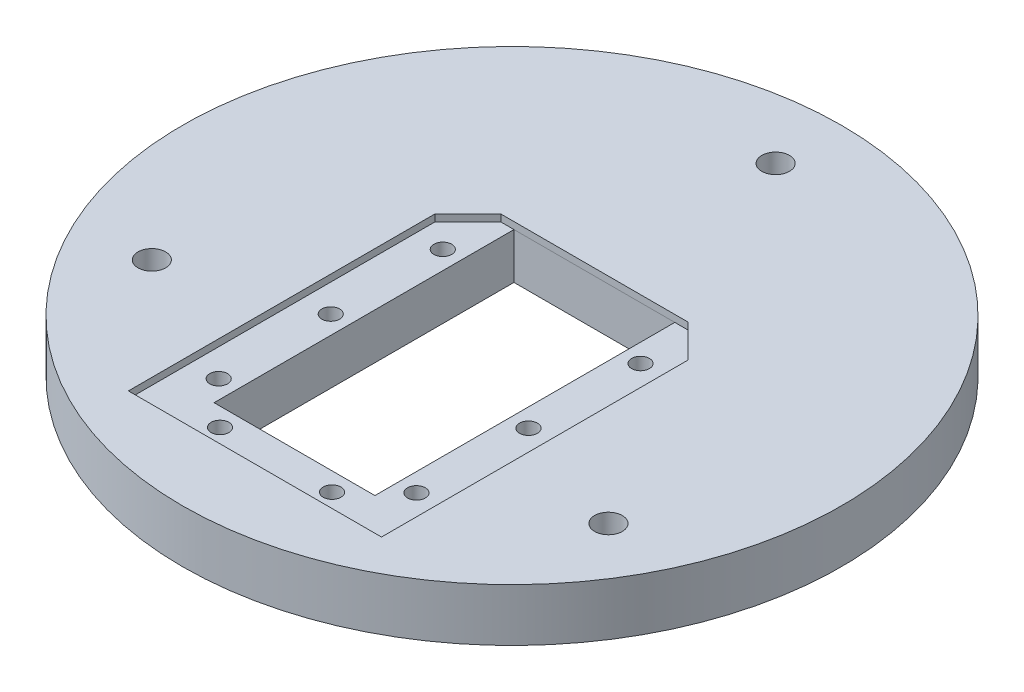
from build123d import *

# Parameters (mm, degrees)
SKETCH1_R           = 60
SKETCH1_R_2         = 1.35
SKETCH1_R_3         = 4
BOSS_EXTRUDE1_DEPTH = 10
CUT_EXTRUDE1_DEPTH  = 8
SKETCH6_R           = 60
SKETCH6_W           = 38.400000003
SKETCH6_H           = 51.500000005
BOSS_EXTRUDE2_DEPTH = 8
CHAMFER1_SIZE       = 5
CUT_EXTRUDE6_DEPTH  = 87.34813258
SKETCH13_W          = 159.365981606
SKETCH13_H          = 138.277350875
CUT_EXTRUDE7_DEPTH  = 6.95
SKETCH14_R          = 2.1
CUT_EXTRUDE8_DEPTH  = 86.569284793
SKETCH15_R          = 4
CUT_EXTRUDE9_DEPTH  = 7.05
SKETCH16_W          = 157.574812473
SKETCH16_H          = 128.039677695
CUT_EXTRUDE10_DEPTH = 3.05
SKETCH17_R          = 100
SKETCH17_R_2        = 50
CUT_EXTRUDE11_DEPTH = 86.229103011
SKETCH18_R          = 2.25
CUT_EXTRUDE12_DEPTH = 2.5
LPATTERN1_COUNT     = 3
LPATTERN1_PITCH     = 17
SKETCH19_R          = 2.25
CUT_EXTRUDE13_DEPTH = 2.5
SKETCH20_R          = 2.25
CUT_EXTRUDE14_DEPTH = 2.5
SKETCH21_R          = 2.25
CUT_EXTRUDE15_DEPTH = 2.5
LPATTERN2_COUNT     = 3
LPATTERN2_PITCH     = 17


with BuildPart() as part:
    # Sketch1 → Boss-Extrude1 (new body)
    with BuildSketch(Plane(origin=(0, 0, 0), x_dir=(1, 0, 0), z_dir=(0, 1, 0))):
        with Locations(Location((0, 0, 0), (0, 0, 270))):
            Circle(SKETCH1_R)
        with Locations(Location((-15, 4.5, 0), (0, 0, 270))):
            Circle(SKETCH1_R_2, mode=Mode.SUBTRACT)
        with Locations(Location((-15, -12.5, 0), (0, 0, 270))):
            Circle(SKETCH1_R_2, mode=Mode.SUBTRACT)
        with Locations(Location((-15, -29.5, 0), (0, 0, 270))):
            Circle(SKETCH1_R_2, mode=Mode.SUBTRACT)
        with Locations(Location((-8.5, -35.8, 0), (0, 0, 270))):
            Circle(SKETCH1_R_2, mode=Mode.SUBTRACT)
        with Locations(Location((8.5, -35.8, 0), (0, 0, 270))):
            Circle(SKETCH1_R_2, mode=Mode.SUBTRACT)
        with Locations(Location((15, -29.5, 0), (0, 0, 270))):
            Circle(SKETCH1_R_2, mode=Mode.SUBTRACT)
        with Locations(Location((15, -12.5, 0), (0, 0, 270))):
            Circle(SKETCH1_R_2, mode=Mode.SUBTRACT)
        with Locations(Location((15, 4.5, 0), (0, 0, 270))):
            Circle(SKETCH1_R_2, mode=Mode.SUBTRACT)
        with Locations(Location((0, 0, 0), (0, 0, 270))):
            Circle(SKETCH1_R_3, mode=Mode.SUBTRACT)
    extrude(amount=BOSS_EXTRUDE1_DEPTH)

    # Sketch2 → Cut-Extrude1 (cut)
    with BuildSketch(Plane(origin=(0, 10, 0), x_dir=(1, 0, 0), z_dir=(0, 1, 0))):
        Polygon((-12.199837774, 12.50015833), (-12.200428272, -32.999841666), (12.199571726, -33.000158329), (12.200162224, 12.499841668), align=None)
    extrude(amount=-CUT_EXTRUDE1_DEPTH, mode=Mode.SUBTRACT)

    # Sketch6 → Boss-Extrude2 (add)
    with BuildSketch(Plane(origin=(0, 10, 0), x_dir=(1, 0, 0), z_dir=(0, 1, 0))):
        with Locations(Location((0, 0, 0), (0, 0, 270))):
            Circle(SKETCH6_R)
        with Locations((0.000162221, -13.25024918)):
            Rectangle(SKETCH6_W, SKETCH6_H, mode=Mode.SUBTRACT)
    extrude(amount=BOSS_EXTRUDE2_DEPTH)

    # Chamfer1
    chamfer1_edges = [part.edges().sort_by_distance(p)[0] for p in [
        (-19.19983778, 14, -12.499750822),
        (19.200162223, 14, -12.499750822),
    ]]
    chamfer(chamfer1_edges, length=CHAMFER1_SIZE)

    # Sketch12 → Cut-Extrude6 (cut, through all)
    with BuildSketch(Plane(origin=(0, 2, 0), x_dir=(1, 0, 0), z_dir=(0, 1, 0))):
        Polygon((12.200162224, 12.499841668), (-12.199837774, 12.50015833), (-12.200428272, -32.999841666), (12.199571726, -33.000158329), align=None)
    extrude(amount=-CUT_EXTRUDE6_DEPTH, mode=Mode.SUBTRACT)

    # Sketch13 → Cut-Extrude7 (cut)
    with BuildSketch(Plane(origin=(0, 18, 0), x_dir=(1, 0, 0), z_dir=(0, 1, 0))):
        with Locations((-0.934306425, -1.920871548)):
            Rectangle(SKETCH13_W, SKETCH13_H)
    extrude(amount=-CUT_EXTRUDE7_DEPTH, mode=Mode.SUBTRACT)

    # Sketch14 → Cut-Extrude8 (cut, through all)
    with BuildSketch(Plane.XZ):
        with Locations(Location((-34.640259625, 20.004835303, 0), (0, 0, 270))):
            Circle(SKETCH14_R)
        with Locations(Location((34.63707466, 20.003132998, 0), (0, 0, 270))):
            Circle(SKETCH14_R)
        with Locations(Location((0.001, -39.995774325, 0), (0, 0, 270))):
            Circle(SKETCH14_R)
    extrude(amount=-CUT_EXTRUDE8_DEPTH, mode=Mode.SUBTRACT)

    # Sketch15 → Cut-Extrude9 (cut)
    with BuildSketch(Plane.XZ):
        with Locations(Location((34.63707466, 20.003132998, 0), (0, 0, 270))):
            Circle(SKETCH15_R)
        with Locations(Location((-34.640259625, 20.004835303, 0), (0, 0, 270))):
            Circle(SKETCH15_R)
        with Locations(Location((0.001, -39.995774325, 0), (0, 0, 270))):
            Circle(SKETCH15_R)
    extrude(amount=-CUT_EXTRUDE9_DEPTH, mode=Mode.SUBTRACT)

    # Sketch16 → Cut-Extrude10 (cut)
    with BuildSketch(Plane.XZ):
        with Locations((0.243421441, -1.785090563)):
            Rectangle(SKETCH16_W, SKETCH16_H)
    extrude(amount=-CUT_EXTRUDE10_DEPTH, mode=Mode.SUBTRACT)

    # Sketch17 → Cut-Extrude11 (cut, through all)
    with BuildSketch(Plane(origin=(0, 11.05, 0), x_dir=(1, 0, 0), z_dir=(0, 1, 0))):
        Circle(SKETCH17_R)
        with Locations(Location((0, 0, 0), (0, 0, 270))):
            Circle(SKETCH17_R_2, mode=Mode.SUBTRACT)
    extrude(amount=-CUT_EXTRUDE11_DEPTH, mode=Mode.SUBTRACT)

    # Sketch18 → Cut-Extrude12 (cut)
    with BuildSketch(Plane.XZ.offset(-3.05)):
        with Locations(Location((15, 29.5, 0), (0, 0, 270))):
            Circle(SKETCH18_R)
    cut_extrude12 = extrude(amount=-CUT_EXTRUDE12_DEPTH, mode=Mode.SUBTRACT)

    # LPattern1: Cut-Extrude12 ×3
    with Locations(*[(0, 0, -i * LPATTERN1_PITCH) for i in range(1, LPATTERN1_COUNT)]):
        add(cut_extrude12, mode=Mode.SUBTRACT)

    # Sketch19 → Cut-Extrude13 (cut)
    with BuildSketch(Plane.XZ.offset(-3.05)):
        with Locations(Location((8.5, 35.8, 0), (0, 0, 270))):
            Circle(SKETCH19_R)
    extrude(amount=-CUT_EXTRUDE13_DEPTH, mode=Mode.SUBTRACT)

    # Sketch20 → Cut-Extrude14 (cut)
    with BuildSketch(Plane.XZ.offset(-3.05)):
        with Locations(Location((-8.5, 35.8, 0), (0, 0, 270))):
            Circle(SKETCH20_R)
    extrude(amount=-CUT_EXTRUDE14_DEPTH, mode=Mode.SUBTRACT)

    # Sketch21 → Cut-Extrude15 (cut)
    with BuildSketch(Plane.XZ.offset(-3.05)):
        with Locations(Location((-15, 29.5, 0), (0, 0, 270))):
            Circle(SKETCH21_R)
    cut_extrude15 = extrude(amount=-CUT_EXTRUDE15_DEPTH, mode=Mode.SUBTRACT)

    # LPattern2: Cut-Extrude15 ×3
    with Locations(*[(0, 0, -i * LPATTERN2_PITCH) for i in range(1, LPATTERN2_COUNT)]):
        add(cut_extrude15, mode=Mode.SUBTRACT)


solid = part.part
